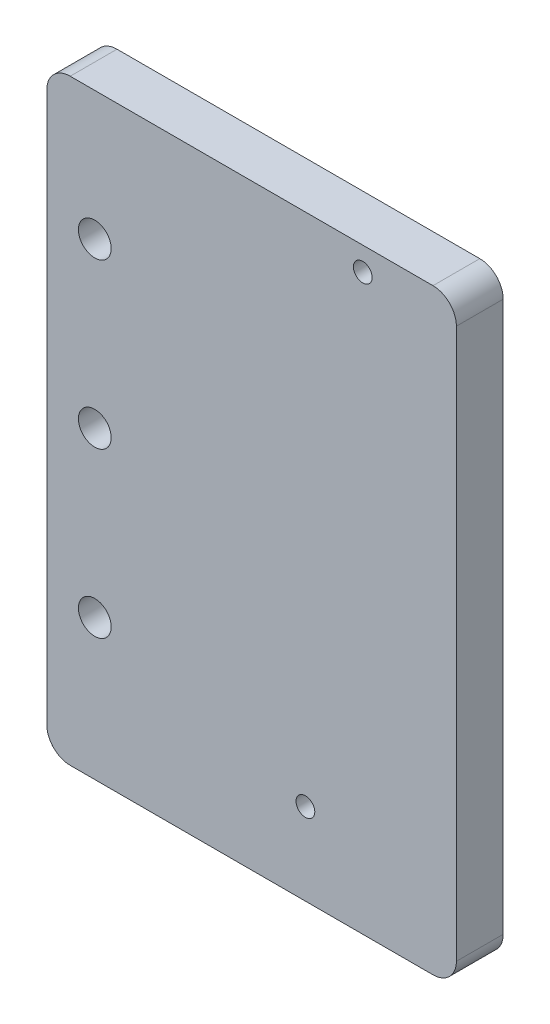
from build123d import *

# Parameters (mm, degrees)
EXTRUSION1_DEPTH           = 20
TROU_TARAUD_M16X2_01_D     = 14
TROU_TARAUD_M16X2_01_DEPTH = 30
TROU_TARAUD_M16X2_01_TIP   = 4.206024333
TROU_TARAUD_M10X1_51_D     = 8
TROU_TARAUD_M10X1_51_DEPTH = 33
TROU_TARAUD_M10X1_51_TIP   = 2.403442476


with BuildPart() as part:
    # Esquisse1 → Extrusion1 (new body)
    with BuildSketch(Plane.XY):
        with BuildLine():
            Line((10, 0), (165, 0))
            ThreePointArc((165, 0), (172.071067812, 2.928932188), (175, 10))
            Line((175, 10), (175, 245))
            ThreePointArc((175, 245), (172.071067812, 252.071067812), (165, 255))
            Line((165, 255), (10, 255))
            ThreePointArc((10, 255), (2.928932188, 252.071067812), (0, 245))
            Line((0, 245), (0, 10))
            ThreePointArc((0, 10), (2.928932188, 2.928932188), (10, 0))
        make_face()
    extrude(amount=EXTRUSION1_DEPTH)

    # Trou taraud_ M16x2.01
    with Locations(Plane(origin=(20.5, 60, 0), x_dir=(-1, 0, 0), z_dir=(0, 0, -1))):
        with Locations((0, 0), (0, 70), (0, 140)):
            Hole(TROU_TARAUD_M16X2_01_D / 2, depth=TROU_TARAUD_M16X2_01_DEPTH)
            with Locations((0, 0, -(TROU_TARAUD_M16X2_01_DEPTH + TROU_TARAUD_M16X2_01_TIP / 2))):  # 118° drill point
                Cone(0, TROU_TARAUD_M16X2_01_D / 2, TROU_TARAUD_M16X2_01_TIP, mode=Mode.SUBTRACT)

    # Trou taraud_ M10x1.51
    with Locations(Plane(origin=(0, 0, 0), x_dir=(-1, 0, 0), z_dir=(0, 0, -1))):
        with Locations((-110.5, 35), (-135, 245)):
            Hole(TROU_TARAUD_M10X1_51_D / 2, depth=TROU_TARAUD_M10X1_51_DEPTH)
            with Locations((0, 0, -(TROU_TARAUD_M10X1_51_DEPTH + TROU_TARAUD_M10X1_51_TIP / 2))):  # 118° drill point
                Cone(0, TROU_TARAUD_M10X1_51_D / 2, TROU_TARAUD_M10X1_51_TIP, mode=Mode.SUBTRACT)


solid = part.part
